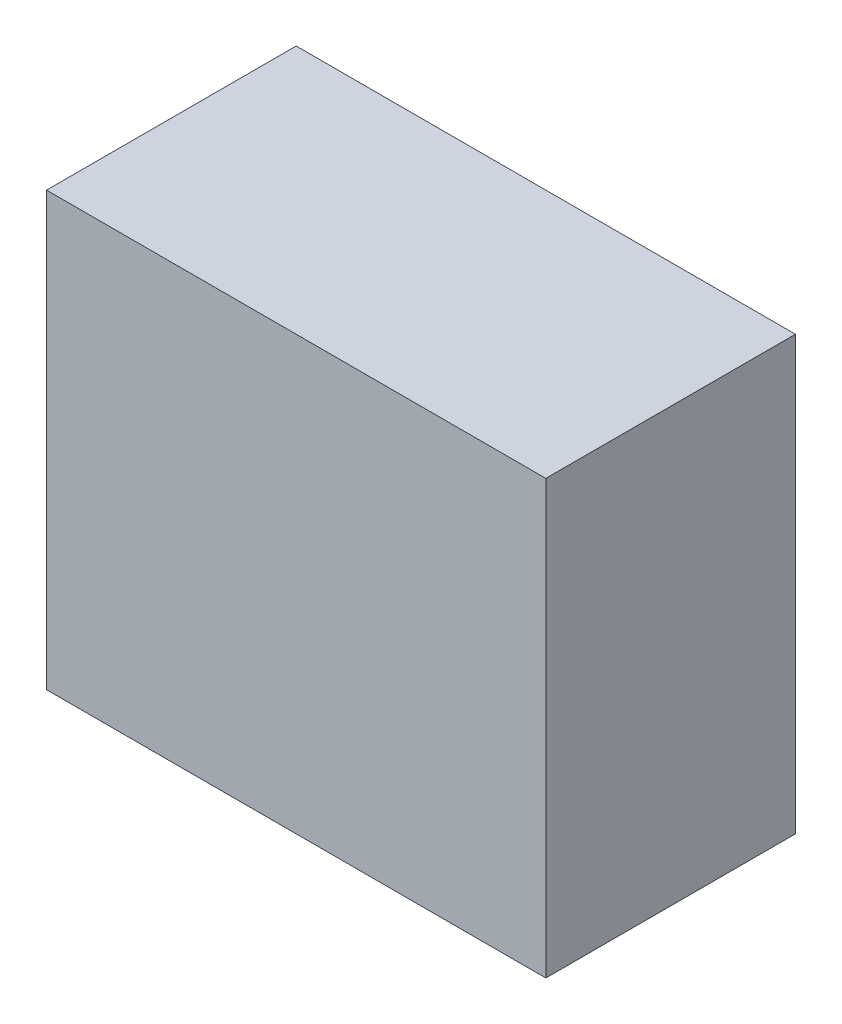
ISO-10303-21;
HEADER;
FILE_DESCRIPTION(('STEP AP214'),'2;1');
FILE_NAME('part.step','',(''),(''),'','','');
FILE_SCHEMA(('AUTOMOTIVE_DESIGN { 1 0 10303 214 1 1 1 1 }'));
ENDSEC;
DATA;
#1=APPLICATION_CONTEXT('core data for automotive mechanical design processes');
#2=APPLICATION_PROTOCOL_DEFINITION('international standard','automotive_design',2000,#1);
#3=PRODUCT_CONTEXT('',#1,'mechanical');
#4=PRODUCT('Part','Part','',(#3));
#5=PRODUCT_RELATED_PRODUCT_CATEGORY('part','',(#4));
#6=PRODUCT_DEFINITION_FORMATION('','',#4);
#7=PRODUCT_DEFINITION_CONTEXT('part definition',#1,'design');
#8=PRODUCT_DEFINITION('design','',#6,#7);
#9=PRODUCT_DEFINITION_SHAPE('','',#8);
#10=(LENGTH_UNIT() NAMED_UNIT(*) SI_UNIT(.MILLI.,.METRE.));
#11=(NAMED_UNIT(*) PLANE_ANGLE_UNIT() SI_UNIT($,.RADIAN.));
#12=(NAMED_UNIT(*) SI_UNIT($,.STERADIAN.) SOLID_ANGLE_UNIT());
#13=UNCERTAINTY_MEASURE_WITH_UNIT(LENGTH_MEASURE(1.E-05),#10,'distance_accuracy_value','');
#14=(GEOMETRIC_REPRESENTATION_CONTEXT(3) GLOBAL_UNCERTAINTY_ASSIGNED_CONTEXT((#13)) GLOBAL_UNIT_ASSIGNED_CONTEXT((#10,
#11,#12)) REPRESENTATION_CONTEXT('',''));
#15=CARTESIAN_POINT('',(0.,0.,0.));
#16=DIRECTION('',(0.,0.,1.));
#17=DIRECTION('',(1.,0.,0.));
#18=AXIS2_PLACEMENT_3D('',#15,#16,#17);
#19=CARTESIAN_POINT('',(1.5,1.3,1.5));
#20=DIRECTION('',(-1.,0.,0.));
#21=DIRECTION('',(0.,0.,1.));
#22=AXIS2_PLACEMENT_3D('',#19,#20,#21);
#23=PLANE('',#22);
#24=DIRECTION('',(0.,1.,0.));
#25=VECTOR('',#24,1.);
#26=CARTESIAN_POINT('',(1.5,1.3,0.));
#27=LINE('',#26,#25);
#28=CARTESIAN_POINT('',(1.5,-1.3,0.));
#29=VERTEX_POINT('',#28);
#30=CARTESIAN_POINT('',(1.5,1.3,0.));
#31=VERTEX_POINT('',#30);
#32=EDGE_CURVE('E89',#29,#31,#27,.T.);
#33=ORIENTED_EDGE('',*,*,#32,.T.);
#34=DIRECTION('',(0.,0.,-1.));
#35=VECTOR('',#34,1.);
#36=CARTESIAN_POINT('',(1.5,1.3,1.5));
#37=LINE('',#36,#35);
#38=CARTESIAN_POINT('',(1.5,1.3,1.5));
#39=VERTEX_POINT('',#38);
#40=EDGE_CURVE('E11',#39,#31,#37,.T.);
#41=ORIENTED_EDGE('',*,*,#40,.F.);
#42=DIRECTION('',(0.,1.,0.));
#43=VECTOR('',#42,1.);
#44=CARTESIAN_POINT('',(1.5,1.3,1.5));
#45=LINE('',#44,#43);
#46=CARTESIAN_POINT('',(1.5,-1.3,1.5));
#47=VERTEX_POINT('',#46);
#48=EDGE_CURVE('E98',#47,#39,#45,.T.);
#49=ORIENTED_EDGE('',*,*,#48,.F.);
#50=DIRECTION('',(0.,0.,-1.));
#51=VECTOR('',#50,1.);
#52=CARTESIAN_POINT('',(1.5,-1.3,1.5));
#53=LINE('',#52,#51);
#54=EDGE_CURVE('E42',#47,#29,#53,.T.);
#55=ORIENTED_EDGE('',*,*,#54,.T.);
#56=EDGE_LOOP('',(#33,#41,#49,#55));
#57=FACE_BOUND('',#56,.T.);
#58=ADVANCED_FACE('F34',(#57),#23,.F.);
#59=CARTESIAN_POINT('',(0.,1.3,1.5));
#60=DIRECTION('',(0.,-1.,0.));
#61=DIRECTION('',(0.,0.,-1.));
#62=AXIS2_PLACEMENT_3D('',#59,#60,#61);
#63=PLANE('',#62);
#64=DIRECTION('',(-1.,0.,0.));
#65=VECTOR('',#64,1.);
#66=CARTESIAN_POINT('',(0.,1.3,0.));
#67=LINE('',#66,#65);
#68=CARTESIAN_POINT('',(-1.5,1.3,0.));
#69=VERTEX_POINT('',#68);
#70=EDGE_CURVE('E62',#31,#69,#67,.T.);
#71=ORIENTED_EDGE('',*,*,#70,.T.);
#72=DIRECTION('',(0.,0.,1.));
#73=VECTOR('',#72,1.);
#74=CARTESIAN_POINT('',(-1.5,1.3,0.));
#75=LINE('',#74,#73);
#76=CARTESIAN_POINT('',(-1.5,1.3,1.5));
#77=VERTEX_POINT('',#76);
#78=EDGE_CURVE('E90',#69,#77,#75,.T.);
#79=ORIENTED_EDGE('',*,*,#78,.T.);
#80=DIRECTION('',(-1.,0.,0.));
#81=VECTOR('',#80,1.);
#82=CARTESIAN_POINT('',(0.,1.3,1.5));
#83=LINE('',#82,#81);
#84=EDGE_CURVE('E81',#39,#77,#83,.T.);
#85=ORIENTED_EDGE('',*,*,#84,.F.);
#86=ORIENTED_EDGE('',*,*,#40,.T.);
#87=EDGE_LOOP('',(#71,#79,#85,#86));
#88=FACE_BOUND('',#87,.T.);
#89=ADVANCED_FACE('F117',(#88),#63,.F.);
#90=CARTESIAN_POINT('',(0.,-1.3,1.5));
#91=DIRECTION('',(0.,1.,0.));
#92=DIRECTION('',(0.,0.,1.));
#93=AXIS2_PLACEMENT_3D('',#90,#91,#92);
#94=PLANE('',#93);
#95=DIRECTION('',(1.,0.,0.));
#96=VECTOR('',#95,1.);
#97=CARTESIAN_POINT('',(0.,-1.3,0.));
#98=LINE('',#97,#96);
#99=CARTESIAN_POINT('',(-1.5,-1.3,0.));
#100=VERTEX_POINT('',#99);
#101=EDGE_CURVE('E67',#100,#29,#98,.T.);
#102=ORIENTED_EDGE('',*,*,#101,.T.);
#103=ORIENTED_EDGE('',*,*,#54,.F.);
#104=DIRECTION('',(1.,0.,0.));
#105=VECTOR('',#104,1.);
#106=CARTESIAN_POINT('',(0.,-1.3,1.5));
#107=LINE('',#106,#105);
#108=CARTESIAN_POINT('',(-1.5,-1.3,1.5));
#109=VERTEX_POINT('',#108);
#110=EDGE_CURVE('E50',#109,#47,#107,.T.);
#111=ORIENTED_EDGE('',*,*,#110,.F.);
#112=DIRECTION('',(0.,0.,1.));
#113=VECTOR('',#112,1.);
#114=CARTESIAN_POINT('',(-1.5,-1.3,0.));
#115=LINE('',#114,#113);
#116=EDGE_CURVE('E77',#100,#109,#115,.T.);
#117=ORIENTED_EDGE('',*,*,#116,.F.);
#118=EDGE_LOOP('',(#102,#103,#111,#117));
#119=FACE_BOUND('',#118,.T.);
#120=ADVANCED_FACE('F76',(#119),#94,.F.);
#121=CARTESIAN_POINT('',(0.,0.,1.5));
#122=DIRECTION('',(0.,0.,1.));
#123=DIRECTION('',(1.,0.,0.));
#124=AXIS2_PLACEMENT_3D('',#121,#122,#123);
#125=PLANE('',#124);
#126=ORIENTED_EDGE('',*,*,#48,.T.);
#127=ORIENTED_EDGE('',*,*,#84,.T.);
#128=DIRECTION('',(0.,-1.,0.));
#129=VECTOR('',#128,1.);
#130=CARTESIAN_POINT('',(-1.5,1.3,1.5));
#131=LINE('',#130,#129);
#132=EDGE_CURVE('E87',#77,#109,#131,.T.);
#133=ORIENTED_EDGE('',*,*,#132,.T.);
#134=ORIENTED_EDGE('',*,*,#110,.T.);
#135=EDGE_LOOP('',(#126,#127,#133,#134));
#136=FACE_BOUND('',#135,.T.);
#137=ADVANCED_FACE('F92',(#136),#125,.T.);
#138=CARTESIAN_POINT('',(0.,0.,0.));
#139=DIRECTION('',(0.,0.,1.));
#140=DIRECTION('',(1.,0.,0.));
#141=AXIS2_PLACEMENT_3D('',#138,#139,#140);
#142=PLANE('',#141);
#143=ORIENTED_EDGE('',*,*,#32,.F.);
#144=ORIENTED_EDGE('',*,*,#101,.F.);
#145=DIRECTION('',(0.,-1.,0.));
#146=VECTOR('',#145,1.);
#147=CARTESIAN_POINT('',(-1.5,1.3,0.));
#148=LINE('',#147,#146);
#149=EDGE_CURVE('E88',#69,#100,#148,.T.);
#150=ORIENTED_EDGE('',*,*,#149,.F.);
#151=ORIENTED_EDGE('',*,*,#70,.F.);
#152=EDGE_LOOP('',(#143,#144,#150,#151));
#153=FACE_BOUND('',#152,.T.);
#154=ADVANCED_FACE('F106',(#153),#142,.F.);
#155=CARTESIAN_POINT('',(-1.5,1.3,0.));
#156=DIRECTION('',(-1.,0.,0.));
#157=DIRECTION('',(0.,-1.,0.));
#158=AXIS2_PLACEMENT_3D('',#155,#156,#157);
#159=PLANE('',#158);
#160=ORIENTED_EDGE('',*,*,#132,.F.);
#161=ORIENTED_EDGE('',*,*,#78,.F.);
#162=ORIENTED_EDGE('',*,*,#149,.T.);
#163=ORIENTED_EDGE('',*,*,#116,.T.);
#164=EDGE_LOOP('',(#160,#161,#162,#163));
#165=FACE_BOUND('',#164,.T.);
#166=ADVANCED_FACE('F85',(#165),#159,.T.);
#167=CLOSED_SHELL('',(#58,#89,#120,#137,#154,#166));
#168=MANIFOLD_SOLID_BREP('B2',#167);
#169=ADVANCED_BREP_SHAPE_REPRESENTATION('',(#18,#168),#14);
#170=SHAPE_DEFINITION_REPRESENTATION(#9,#169);
ENDSEC;
END-ISO-10303-21;
